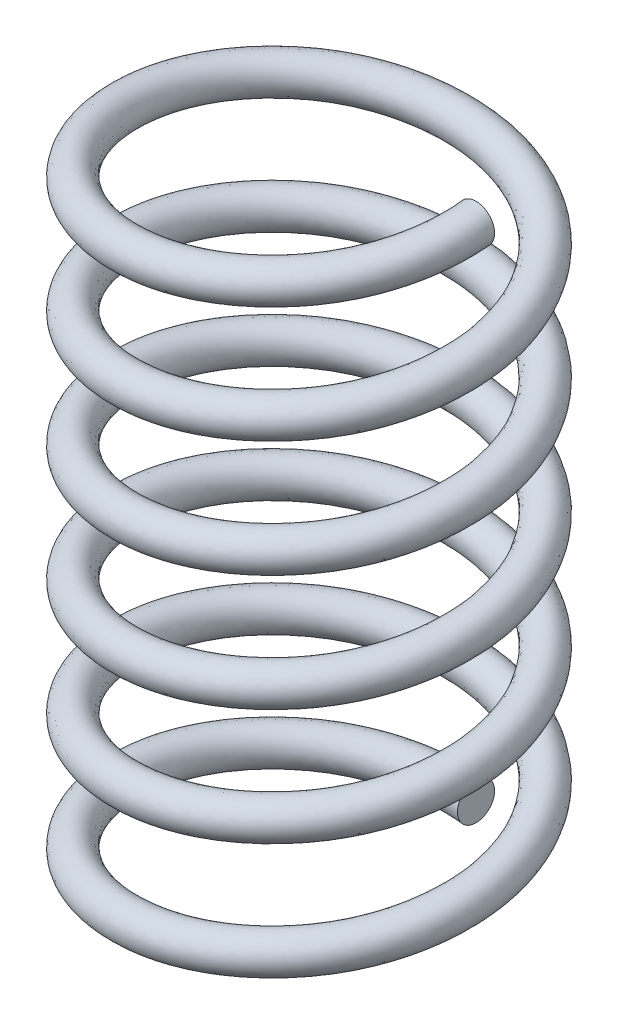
ISO-10303-21;
HEADER;
FILE_DESCRIPTION(('STEP AP214'),'2;1');
FILE_NAME('part.step','',(''),(''),'','','');
FILE_SCHEMA(('AUTOMOTIVE_DESIGN { 1 0 10303 214 1 1 1 1 }'));
ENDSEC;
DATA;
#1=APPLICATION_CONTEXT('core data for automotive mechanical design processes');
#2=APPLICATION_PROTOCOL_DEFINITION('international standard','automotive_design',2000,#1);
#3=PRODUCT_CONTEXT('',#1,'mechanical');
#4=PRODUCT('Part','Part','',(#3));
#5=PRODUCT_RELATED_PRODUCT_CATEGORY('part','',(#4));
#6=PRODUCT_DEFINITION_FORMATION('','',#4);
#7=PRODUCT_DEFINITION_CONTEXT('part definition',#1,'design');
#8=PRODUCT_DEFINITION('design','',#6,#7);
#9=PRODUCT_DEFINITION_SHAPE('','',#8);
#10=(LENGTH_UNIT() NAMED_UNIT(*) SI_UNIT(.MILLI.,.METRE.));
#11=(NAMED_UNIT(*) PLANE_ANGLE_UNIT() SI_UNIT($,.RADIAN.));
#12=(NAMED_UNIT(*) SI_UNIT($,.STERADIAN.) SOLID_ANGLE_UNIT());
#13=UNCERTAINTY_MEASURE_WITH_UNIT(LENGTH_MEASURE(1.E-05),#10,'distance_accuracy_value','');
#14=(GEOMETRIC_REPRESENTATION_CONTEXT(3) GLOBAL_UNCERTAINTY_ASSIGNED_CONTEXT((#13)) GLOBAL_UNIT_ASSIGNED_CONTEXT((#10,
#11,#12)) REPRESENTATION_CONTEXT('',''));
#15=CARTESIAN_POINT('',(0.,0.,0.));
#16=DIRECTION('',(0.,0.,1.));
#17=DIRECTION('',(1.,0.,0.));
#18=AXIS2_PLACEMENT_3D('',#15,#16,#17);
#19=CARTESIAN_POINT('',(0.,0.,-22.5));
#20=DIRECTION('',(1.,0.,0.));
#21=DIRECTION('',(0.,0.,-1.));
#22=AXIS2_PLACEMENT_3D('',#19,#20,#21);
#23=PLANE('',#22);
#24=CARTESIAN_POINT('',(0.,0.,-22.5));
#25=DIRECTION('',(1.,0.,0.));
#26=DIRECTION('',(0.,0.,-1.));
#27=AXIS2_PLACEMENT_3D('',#24,#25,#26);
#28=CIRCLE('',#27,2.5);
#29=CARTESIAN_POINT('',(0.,0.,-25.));
#30=VERTEX_POINT('',#29);
#31=EDGE_CURVE('E44',#30,#30,#28,.T.);
#32=ORIENTED_EDGE('',*,*,#31,.T.);
#33=EDGE_LOOP('',(#32));
#34=FACE_BOUND('',#33,.T.);
#35=ADVANCED_FACE('F39',(#34),#23,.T.);
#36=CARTESIAN_POINT('',(22.5,90.,-1.84680962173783E-12));
#37=DIRECTION('',(0.,0.,1.));
#38=DIRECTION('',(1.,0.,0.));
#39=AXIS2_PLACEMENT_3D('',#36,#37,#38);
#40=PLANE('',#39);
#41=CARTESIAN_POINT('',(22.5,90.,-1.84680962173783E-12));
#42=DIRECTION('',(0.,0.,1.));
#43=DIRECTION('',(1.,0.,0.));
#44=AXIS2_PLACEMENT_3D('',#41,#42,#43);
#45=CIRCLE('',#44,2.5);
#46=CARTESIAN_POINT('',(25.,90.,-2.05201069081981E-12));
#47=VERTEX_POINT('',#46);
#48=EDGE_CURVE('E10',#47,#47,#45,.T.);
#49=ORIENTED_EDGE('',*,*,#48,.F.);
#50=EDGE_LOOP('',(#49));
#51=FACE_BOUND('',#50,.T.);
#52=ADVANCED_FACE('F53',(#51),#40,.F.);
#53=CARTESIAN_POINT('',(0.,0.,-25.));
#54=CARTESIAN_POINT('',(-10.3553390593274,0.978260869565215,-25.));
#55=CARTESIAN_POINT('',(-17.6776695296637,1.95652173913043,-17.6776695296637));
#56=CARTESIAN_POINT('',(-25.,2.93478260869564,-10.3553390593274));
#57=CARTESIAN_POINT('',(-25.,3.91304347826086,0.));
#58=CARTESIAN_POINT('',(-25.,4.89130434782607,10.3553390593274));
#59=CARTESIAN_POINT('',(-17.6776695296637,5.86956521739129,17.6776695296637));
#60=CARTESIAN_POINT('',(-10.3553390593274,6.8478260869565,25.));
#61=CARTESIAN_POINT('',(0.,7.82608695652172,25.));
#62=CARTESIAN_POINT('',(10.3553390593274,8.80434782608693,25.));
#63=CARTESIAN_POINT('',(17.6776695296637,9.78260869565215,17.6776695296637));
#64=CARTESIAN_POINT('',(25.,10.7608695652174,10.3553390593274));
#65=CARTESIAN_POINT('',(25.,11.7391304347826,0.));
#66=CARTESIAN_POINT('',(25.,12.7173913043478,-10.3553390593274));
#67=CARTESIAN_POINT('',(17.6776695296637,13.695652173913,-17.6776695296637));
#68=CARTESIAN_POINT('',(10.3553390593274,14.6739130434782,-25.));
#69=CARTESIAN_POINT('',(0.,15.6521739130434,-25.));
#70=CARTESIAN_POINT('',(-10.3553390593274,16.6304347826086,-25.));
#71=CARTESIAN_POINT('',(-17.6776695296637,17.6086956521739,-17.6776695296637));
#72=CARTESIAN_POINT('',(-25.,18.5869565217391,-10.3553390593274));
#73=CARTESIAN_POINT('',(-25.,19.5652173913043,0.));
#74=CARTESIAN_POINT('',(-25.,20.5434782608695,10.3553390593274));
#75=CARTESIAN_POINT('',(-17.6776695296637,21.5217391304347,17.6776695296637));
#76=CARTESIAN_POINT('',(-10.3553390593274,22.4999999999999,25.));
#77=CARTESIAN_POINT('',(0.,23.4782608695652,25.));
#78=CARTESIAN_POINT('',(10.3553390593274,24.4565217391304,25.));
#79=CARTESIAN_POINT('',(17.6776695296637,25.4347826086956,17.6776695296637));
#80=CARTESIAN_POINT('',(25.,26.4130434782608,10.3553390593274));
#81=CARTESIAN_POINT('',(25.,27.391304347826,0.));
#82=CARTESIAN_POINT('',(25.,28.3695652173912,-10.3553390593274));
#83=CARTESIAN_POINT('',(17.6776695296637,29.3478260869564,-17.6776695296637));
#84=CARTESIAN_POINT('',(10.3553390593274,30.3260869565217,-25.));
#85=CARTESIAN_POINT('',(0.,31.3043478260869,-25.));
#86=CARTESIAN_POINT('',(-10.3553390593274,32.2826086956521,-25.));
#87=CARTESIAN_POINT('',(-17.6776695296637,33.2608695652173,-17.6776695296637));
#88=CARTESIAN_POINT('',(-25.,34.2391304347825,-10.3553390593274));
#89=CARTESIAN_POINT('',(-25.,35.2173913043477,0.));
#90=CARTESIAN_POINT('',(-25.,36.1956521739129,10.3553390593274));
#91=CARTESIAN_POINT('',(-17.6776695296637,37.1739130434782,17.6776695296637));
#92=CARTESIAN_POINT('',(-10.3553390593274,38.1521739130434,25.));
#93=CARTESIAN_POINT('',(0.,39.1304347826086,25.));
#94=CARTESIAN_POINT('',(10.3553390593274,40.1086956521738,25.));
#95=CARTESIAN_POINT('',(17.6776695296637,41.086956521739,17.6776695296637));
#96=CARTESIAN_POINT('',(25.,42.0652173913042,10.3553390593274));
#97=CARTESIAN_POINT('',(25.,43.0434782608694,0.));
#98=CARTESIAN_POINT('',(25.,44.0217391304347,-10.3553390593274));
#99=CARTESIAN_POINT('',(17.6776695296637,44.9999999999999,-17.6776695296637));
#100=CARTESIAN_POINT('',(10.3553390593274,45.9782608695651,-25.));
#101=CARTESIAN_POINT('',(0.,46.9565217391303,-25.));
#102=CARTESIAN_POINT('',(-10.3553390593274,47.9347826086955,-25.));
#103=CARTESIAN_POINT('',(-17.6776695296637,48.9130434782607,-17.6776695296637));
#104=CARTESIAN_POINT('',(-25.,49.891304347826,-10.3553390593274));
#105=CARTESIAN_POINT('',(-25.,50.8695652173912,0.));
#106=CARTESIAN_POINT('',(-25.,51.8478260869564,10.3553390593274));
#107=CARTESIAN_POINT('',(-17.6776695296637,52.8260869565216,17.6776695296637));
#108=CARTESIAN_POINT('',(-10.3553390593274,53.8043478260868,25.));
#109=CARTESIAN_POINT('',(0.,54.782608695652,25.));
#110=CARTESIAN_POINT('',(10.3553390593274,55.7608695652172,25.));
#111=CARTESIAN_POINT('',(17.6776695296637,56.7391304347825,17.6776695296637));
#112=CARTESIAN_POINT('',(25.,57.7173913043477,10.3553390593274));
#113=CARTESIAN_POINT('',(25.,58.6956521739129,0.));
#114=CARTESIAN_POINT('',(25.,59.6739130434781,-10.3553390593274));
#115=CARTESIAN_POINT('',(17.6776695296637,60.6521739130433,-17.6776695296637));
#116=CARTESIAN_POINT('',(10.3553390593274,61.6304347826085,-25.));
#117=CARTESIAN_POINT('',(0.,62.6086956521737,-25.));
#118=CARTESIAN_POINT('',(-10.3553390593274,63.586956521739,-25.));
#119=CARTESIAN_POINT('',(-17.6776695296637,64.5652173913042,-17.6776695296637));
#120=CARTESIAN_POINT('',(-25.,65.5434782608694,-10.3553390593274));
#121=CARTESIAN_POINT('',(-25.,66.5217391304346,0.));
#122=CARTESIAN_POINT('',(-25.,67.4999999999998,10.3553390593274));
#123=CARTESIAN_POINT('',(-17.6776695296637,68.478260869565,17.6776695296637));
#124=CARTESIAN_POINT('',(-10.3553390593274,69.4565217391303,25.));
#125=CARTESIAN_POINT('',(0.,70.4347826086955,25.));
#126=CARTESIAN_POINT('',(10.3553390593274,71.4130434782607,25.));
#127=CARTESIAN_POINT('',(17.6776695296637,72.3913043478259,17.6776695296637));
#128=CARTESIAN_POINT('',(25.,73.3695652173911,10.3553390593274));
#129=CARTESIAN_POINT('',(25.,74.3478260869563,0.));
#130=CARTESIAN_POINT('',(25.,75.3260869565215,-10.3553390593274));
#131=CARTESIAN_POINT('',(17.6776695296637,76.3043478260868,-17.6776695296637));
#132=CARTESIAN_POINT('',(10.3553390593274,77.282608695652,-25.));
#133=CARTESIAN_POINT('',(0.,78.2608695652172,-25.));
#134=CARTESIAN_POINT('',(-10.3553390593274,79.2391304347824,-25.));
#135=CARTESIAN_POINT('',(-17.6776695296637,80.2173913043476,-17.6776695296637));
#136=CARTESIAN_POINT('',(-25.,81.1956521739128,-10.3553390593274));
#137=CARTESIAN_POINT('',(-25.,82.173913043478,0.));
#138=CARTESIAN_POINT('',(-25.,83.1521739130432,10.3553390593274));
#139=CARTESIAN_POINT('',(-17.6776695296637,84.1304347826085,17.6776695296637));
#140=CARTESIAN_POINT('',(-10.3553390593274,85.1086956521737,25.));
#141=CARTESIAN_POINT('',(0.,86.0869565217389,25.));
#142=CARTESIAN_POINT('',(10.3553390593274,87.0652173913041,25.));
#143=CARTESIAN_POINT('',(17.6776695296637,88.0434782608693,17.6776695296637));
#144=CARTESIAN_POINT('',(25.,89.0217391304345,10.3553390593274));
#145=CARTESIAN_POINT('',(25.,89.9999999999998,0.));
#146=CARTESIAN_POINT('',(25.,90.978260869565,-10.3553390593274));
#147=CARTESIAN_POINT('',(17.6776695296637,91.9565217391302,-17.6776695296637));
#148=CARTESIAN_POINT('',(10.3553390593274,92.9347826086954,-25.));
#149=CARTESIAN_POINT('',(0.,93.9130434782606,-25.));
#150=CARTESIAN_POINT('',(0.,5.,-25.));
#151=CARTESIAN_POINT('',(-10.3553390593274,5.97826086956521,-25.));
#152=CARTESIAN_POINT('',(-17.6776695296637,6.95652173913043,-17.6776695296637));
#153=CARTESIAN_POINT('',(-25.,7.93478260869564,-10.3553390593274));
#154=CARTESIAN_POINT('',(-25.,8.91304347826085,0.));
#155=CARTESIAN_POINT('',(-25.,9.89130434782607,10.3553390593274));
#156=CARTESIAN_POINT('',(-17.6776695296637,10.8695652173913,17.6776695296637));
#157=CARTESIAN_POINT('',(-10.3553390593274,11.8478260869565,25.));
#158=CARTESIAN_POINT('',(0.,12.8260869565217,25.));
#159=CARTESIAN_POINT('',(10.3553390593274,13.8043478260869,25.));
#160=CARTESIAN_POINT('',(17.6776695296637,14.7826086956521,17.6776695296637));
#161=CARTESIAN_POINT('',(25.,15.7608695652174,10.3553390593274));
#162=CARTESIAN_POINT('',(25.,16.7391304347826,0.));
#163=CARTESIAN_POINT('',(25.,17.7173913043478,-10.3553390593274));
#164=CARTESIAN_POINT('',(17.6776695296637,18.695652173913,-17.6776695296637));
#165=CARTESIAN_POINT('',(10.3553390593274,19.6739130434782,-25.));
#166=CARTESIAN_POINT('',(0.,20.6521739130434,-25.));
#167=CARTESIAN_POINT('',(-10.3553390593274,21.6304347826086,-25.));
#168=CARTESIAN_POINT('',(-17.6776695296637,22.6086956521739,-17.6776695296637));
#169=CARTESIAN_POINT('',(-25.,23.5869565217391,-10.3553390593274));
#170=CARTESIAN_POINT('',(-25.,24.5652173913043,0.));
#171=CARTESIAN_POINT('',(-25.,25.5434782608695,10.3553390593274));
#172=CARTESIAN_POINT('',(-17.6776695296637,26.5217391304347,17.6776695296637));
#173=CARTESIAN_POINT('',(-10.3553390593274,27.4999999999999,25.));
#174=CARTESIAN_POINT('',(0.,28.4782608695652,25.));
#175=CARTESIAN_POINT('',(10.3553390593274,29.4565217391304,25.));
#176=CARTESIAN_POINT('',(17.6776695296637,30.4347826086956,17.6776695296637));
#177=CARTESIAN_POINT('',(25.,31.4130434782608,10.3553390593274));
#178=CARTESIAN_POINT('',(25.,32.391304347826,0.));
#179=CARTESIAN_POINT('',(25.,33.3695652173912,-10.3553390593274));
#180=CARTESIAN_POINT('',(17.6776695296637,34.3478260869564,-17.6776695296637));
#181=CARTESIAN_POINT('',(10.3553390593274,35.3260869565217,-25.));
#182=CARTESIAN_POINT('',(0.,36.3043478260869,-25.));
#183=CARTESIAN_POINT('',(-10.3553390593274,37.2826086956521,-25.));
#184=CARTESIAN_POINT('',(-17.6776695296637,38.2608695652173,-17.6776695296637));
#185=CARTESIAN_POINT('',(-25.,39.2391304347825,-10.3553390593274));
#186=CARTESIAN_POINT('',(-25.,40.2173913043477,0.));
#187=CARTESIAN_POINT('',(-25.,41.1956521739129,10.3553390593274));
#188=CARTESIAN_POINT('',(-17.6776695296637,42.1739130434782,17.6776695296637));
#189=CARTESIAN_POINT('',(-10.3553390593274,43.1521739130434,25.));
#190=CARTESIAN_POINT('',(0.,44.1304347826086,25.));
#191=CARTESIAN_POINT('',(10.3553390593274,45.1086956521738,25.));
#192=CARTESIAN_POINT('',(17.6776695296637,46.086956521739,17.6776695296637));
#193=CARTESIAN_POINT('',(25.,47.0652173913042,10.3553390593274));
#194=CARTESIAN_POINT('',(25.,48.0434782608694,0.));
#195=CARTESIAN_POINT('',(25.,49.0217391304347,-10.3553390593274));
#196=CARTESIAN_POINT('',(17.6776695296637,49.9999999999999,-17.6776695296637));
#197=CARTESIAN_POINT('',(10.3553390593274,50.9782608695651,-25.));
#198=CARTESIAN_POINT('',(0.,51.9565217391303,-25.));
#199=CARTESIAN_POINT('',(-10.3553390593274,52.9347826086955,-25.));
#200=CARTESIAN_POINT('',(-17.6776695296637,53.9130434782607,-17.6776695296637));
#201=CARTESIAN_POINT('',(-25.,54.891304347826,-10.3553390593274));
#202=CARTESIAN_POINT('',(-25.,55.8695652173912,0.));
#203=CARTESIAN_POINT('',(-25.,56.8478260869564,10.3553390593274));
#204=CARTESIAN_POINT('',(-17.6776695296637,57.8260869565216,17.6776695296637));
#205=CARTESIAN_POINT('',(-10.3553390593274,58.8043478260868,25.));
#206=CARTESIAN_POINT('',(0.,59.782608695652,25.));
#207=CARTESIAN_POINT('',(10.3553390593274,60.7608695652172,25.));
#208=CARTESIAN_POINT('',(17.6776695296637,61.7391304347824,17.6776695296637));
#209=CARTESIAN_POINT('',(25.,62.7173913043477,10.3553390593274));
#210=CARTESIAN_POINT('',(25.,63.6956521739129,0.));
#211=CARTESIAN_POINT('',(25.,64.6739130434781,-10.3553390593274));
#212=CARTESIAN_POINT('',(17.6776695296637,65.6521739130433,-17.6776695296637));
#213=CARTESIAN_POINT('',(10.3553390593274,66.6304347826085,-25.));
#214=CARTESIAN_POINT('',(0.,67.6086956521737,-25.));
#215=CARTESIAN_POINT('',(-10.3553390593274,68.586956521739,-25.));
#216=CARTESIAN_POINT('',(-17.6776695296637,69.5652173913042,-17.6776695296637));
#217=CARTESIAN_POINT('',(-25.,70.5434782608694,-10.3553390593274));
#218=CARTESIAN_POINT('',(-25.,71.5217391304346,0.));
#219=CARTESIAN_POINT('',(-25.,72.4999999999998,10.3553390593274));
#220=CARTESIAN_POINT('',(-17.6776695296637,73.478260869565,17.6776695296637));
#221=CARTESIAN_POINT('',(-10.3553390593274,74.4565217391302,25.));
#222=CARTESIAN_POINT('',(0.,75.4347826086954,25.));
#223=CARTESIAN_POINT('',(10.3553390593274,76.4130434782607,25.));
#224=CARTESIAN_POINT('',(17.6776695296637,77.3913043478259,17.6776695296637));
#225=CARTESIAN_POINT('',(25.,78.3695652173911,10.3553390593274));
#226=CARTESIAN_POINT('',(25.,79.3478260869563,0.));
#227=CARTESIAN_POINT('',(25.,80.3260869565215,-10.3553390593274));
#228=CARTESIAN_POINT('',(17.6776695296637,81.3043478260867,-17.6776695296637));
#229=CARTESIAN_POINT('',(10.3553390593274,82.2826086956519,-25.));
#230=CARTESIAN_POINT('',(0.,83.2608695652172,-25.));
#231=CARTESIAN_POINT('',(-10.3553390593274,84.2391304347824,-25.));
#232=CARTESIAN_POINT('',(-17.6776695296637,85.2173913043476,-17.6776695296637));
#233=CARTESIAN_POINT('',(-25.,86.1956521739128,-10.3553390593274));
#234=CARTESIAN_POINT('',(-25.,87.173913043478,0.));
#235=CARTESIAN_POINT('',(-25.,88.1521739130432,10.3553390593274));
#236=CARTESIAN_POINT('',(-17.6776695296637,89.1304347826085,17.6776695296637));
#237=CARTESIAN_POINT('',(-10.3553390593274,90.1086956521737,25.));
#238=CARTESIAN_POINT('',(0.,91.0869565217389,25.));
#239=CARTESIAN_POINT('',(10.3553390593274,92.0652173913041,25.));
#240=CARTESIAN_POINT('',(17.6776695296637,93.0434782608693,17.6776695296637));
#241=CARTESIAN_POINT('',(25.,94.0217391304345,10.3553390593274));
#242=CARTESIAN_POINT('',(25.,94.9999999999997,0.));
#243=CARTESIAN_POINT('',(25.,95.978260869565,-10.3553390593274));
#244=CARTESIAN_POINT('',(17.6776695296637,96.9565217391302,-17.6776695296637));
#245=CARTESIAN_POINT('',(10.3553390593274,97.9347826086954,-25.));
#246=CARTESIAN_POINT('',(0.,98.9130434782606,-25.));
#247=CARTESIAN_POINT('',(0.,5.,-20.));
#248=CARTESIAN_POINT('',(-8.2842712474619,5.97826086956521,-20.));
#249=CARTESIAN_POINT('',(-14.1421356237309,6.95652173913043,-14.142135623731));
#250=CARTESIAN_POINT('',(-20.,7.93478260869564,-8.2842712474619));
#251=CARTESIAN_POINT('',(-20.,8.91304347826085,0.));
#252=CARTESIAN_POINT('',(-20.,9.89130434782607,8.2842712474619));
#253=CARTESIAN_POINT('',(-14.1421356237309,10.8695652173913,14.1421356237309));
#254=CARTESIAN_POINT('',(-8.2842712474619,11.8478260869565,20.));
#255=CARTESIAN_POINT('',(0.,12.8260869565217,20.));
#256=CARTESIAN_POINT('',(8.2842712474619,13.8043478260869,20.));
#257=CARTESIAN_POINT('',(14.1421356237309,14.7826086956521,14.142135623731));
#258=CARTESIAN_POINT('',(20.,15.7608695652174,8.28427124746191));
#259=CARTESIAN_POINT('',(20.,16.7391304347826,0.));
#260=CARTESIAN_POINT('',(20.,17.7173913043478,-8.28427124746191));
#261=CARTESIAN_POINT('',(14.142135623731,18.695652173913,-14.1421356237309));
#262=CARTESIAN_POINT('',(8.28427124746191,19.6739130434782,-20.));
#263=CARTESIAN_POINT('',(0.,20.6521739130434,-20.));
#264=CARTESIAN_POINT('',(-8.2842712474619,21.6304347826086,-20.));
#265=CARTESIAN_POINT('',(-14.1421356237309,22.6086956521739,-14.142135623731));
#266=CARTESIAN_POINT('',(-20.,23.5869565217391,-8.2842712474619));
#267=CARTESIAN_POINT('',(-20.,24.5652173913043,0.));
#268=CARTESIAN_POINT('',(-20.,25.5434782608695,8.2842712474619));
#269=CARTESIAN_POINT('',(-14.1421356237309,26.5217391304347,14.1421356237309));
#270=CARTESIAN_POINT('',(-8.2842712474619,27.4999999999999,20.));
#271=CARTESIAN_POINT('',(0.,28.4782608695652,20.));
#272=CARTESIAN_POINT('',(8.2842712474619,29.4565217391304,20.));
#273=CARTESIAN_POINT('',(14.1421356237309,30.4347826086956,14.142135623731));
#274=CARTESIAN_POINT('',(20.,31.4130434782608,8.28427124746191));
#275=CARTESIAN_POINT('',(20.,32.391304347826,0.));
#276=CARTESIAN_POINT('',(20.,33.3695652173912,-8.28427124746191));
#277=CARTESIAN_POINT('',(14.142135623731,34.3478260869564,-14.1421356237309));
#278=CARTESIAN_POINT('',(8.28427124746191,35.3260869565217,-20.));
#279=CARTESIAN_POINT('',(0.,36.3043478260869,-20.));
#280=CARTESIAN_POINT('',(-8.2842712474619,37.2826086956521,-20.));
#281=CARTESIAN_POINT('',(-14.1421356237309,38.2608695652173,-14.142135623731));
#282=CARTESIAN_POINT('',(-20.,39.2391304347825,-8.2842712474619));
#283=CARTESIAN_POINT('',(-20.,40.2173913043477,0.));
#284=CARTESIAN_POINT('',(-20.,41.1956521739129,8.2842712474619));
#285=CARTESIAN_POINT('',(-14.1421356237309,42.1739130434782,14.1421356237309));
#286=CARTESIAN_POINT('',(-8.2842712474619,43.1521739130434,20.));
#287=CARTESIAN_POINT('',(0.,44.1304347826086,20.));
#288=CARTESIAN_POINT('',(8.2842712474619,45.1086956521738,20.));
#289=CARTESIAN_POINT('',(14.1421356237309,46.086956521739,14.142135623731));
#290=CARTESIAN_POINT('',(20.,47.0652173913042,8.28427124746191));
#291=CARTESIAN_POINT('',(20.,48.0434782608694,0.));
#292=CARTESIAN_POINT('',(20.,49.0217391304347,-8.28427124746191));
#293=CARTESIAN_POINT('',(14.142135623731,49.9999999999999,-14.1421356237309));
#294=CARTESIAN_POINT('',(8.28427124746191,50.9782608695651,-20.));
#295=CARTESIAN_POINT('',(0.,51.9565217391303,-20.));
#296=CARTESIAN_POINT('',(-8.2842712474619,52.9347826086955,-20.));
#297=CARTESIAN_POINT('',(-14.1421356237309,53.9130434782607,-14.142135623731));
#298=CARTESIAN_POINT('',(-20.,54.891304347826,-8.2842712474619));
#299=CARTESIAN_POINT('',(-20.,55.8695652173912,0.));
#300=CARTESIAN_POINT('',(-20.,56.8478260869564,8.2842712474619));
#301=CARTESIAN_POINT('',(-14.1421356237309,57.8260869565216,14.1421356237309));
#302=CARTESIAN_POINT('',(-8.2842712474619,58.8043478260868,20.));
#303=CARTESIAN_POINT('',(0.,59.782608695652,20.));
#304=CARTESIAN_POINT('',(8.2842712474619,60.7608695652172,20.));
#305=CARTESIAN_POINT('',(14.1421356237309,61.7391304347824,14.142135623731));
#306=CARTESIAN_POINT('',(20.,62.7173913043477,8.28427124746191));
#307=CARTESIAN_POINT('',(20.,63.6956521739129,0.));
#308=CARTESIAN_POINT('',(20.,64.6739130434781,-8.28427124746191));
#309=CARTESIAN_POINT('',(14.142135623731,65.6521739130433,-14.1421356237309));
#310=CARTESIAN_POINT('',(8.28427124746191,66.6304347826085,-20.));
#311=CARTESIAN_POINT('',(0.,67.6086956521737,-20.));
#312=CARTESIAN_POINT('',(-8.2842712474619,68.586956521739,-20.));
#313=CARTESIAN_POINT('',(-14.1421356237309,69.5652173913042,-14.142135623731));
#314=CARTESIAN_POINT('',(-20.,70.5434782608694,-8.2842712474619));
#315=CARTESIAN_POINT('',(-20.,71.5217391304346,0.));
#316=CARTESIAN_POINT('',(-20.,72.4999999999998,8.2842712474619));
#317=CARTESIAN_POINT('',(-14.1421356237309,73.478260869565,14.1421356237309));
#318=CARTESIAN_POINT('',(-8.2842712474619,74.4565217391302,20.));
#319=CARTESIAN_POINT('',(0.,75.4347826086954,20.));
#320=CARTESIAN_POINT('',(8.2842712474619,76.4130434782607,20.));
#321=CARTESIAN_POINT('',(14.1421356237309,77.3913043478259,14.142135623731));
#322=CARTESIAN_POINT('',(20.,78.3695652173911,8.28427124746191));
#323=CARTESIAN_POINT('',(20.,79.3478260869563,0.));
#324=CARTESIAN_POINT('',(20.,80.3260869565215,-8.28427124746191));
#325=CARTESIAN_POINT('',(14.142135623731,81.3043478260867,-14.1421356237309));
#326=CARTESIAN_POINT('',(8.28427124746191,82.2826086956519,-20.));
#327=CARTESIAN_POINT('',(0.,83.2608695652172,-20.));
#328=CARTESIAN_POINT('',(-8.2842712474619,84.2391304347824,-20.));
#329=CARTESIAN_POINT('',(-14.1421356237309,85.2173913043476,-14.142135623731));
#330=CARTESIAN_POINT('',(-20.,86.1956521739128,-8.2842712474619));
#331=CARTESIAN_POINT('',(-20.,87.173913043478,0.));
#332=CARTESIAN_POINT('',(-20.,88.1521739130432,8.2842712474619));
#333=CARTESIAN_POINT('',(-14.1421356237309,89.1304347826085,14.1421356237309));
#334=CARTESIAN_POINT('',(-8.2842712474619,90.1086956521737,20.));
#335=CARTESIAN_POINT('',(0.,91.0869565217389,20.));
#336=CARTESIAN_POINT('',(8.2842712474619,92.0652173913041,20.));
#337=CARTESIAN_POINT('',(14.1421356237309,93.0434782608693,14.142135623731));
#338=CARTESIAN_POINT('',(20.,94.0217391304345,8.28427124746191));
#339=CARTESIAN_POINT('',(20.,94.9999999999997,0.));
#340=CARTESIAN_POINT('',(20.,95.978260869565,-8.28427124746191));
#341=CARTESIAN_POINT('',(14.142135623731,96.9565217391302,-14.1421356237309));
#342=CARTESIAN_POINT('',(8.28427124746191,97.9347826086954,-20.));
#343=CARTESIAN_POINT('',(0.,98.9130434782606,-20.));
#344=CARTESIAN_POINT('',(0.,0.,-20.));
#345=CARTESIAN_POINT('',(-8.2842712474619,0.978260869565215,-20.));
#346=CARTESIAN_POINT('',(-14.1421356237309,1.95652173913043,-14.142135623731));
#347=CARTESIAN_POINT('',(-20.,2.93478260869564,-8.2842712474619));
#348=CARTESIAN_POINT('',(-20.,3.91304347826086,0.));
#349=CARTESIAN_POINT('',(-20.,4.89130434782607,8.2842712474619));
#350=CARTESIAN_POINT('',(-14.1421356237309,5.86956521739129,14.1421356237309));
#351=CARTESIAN_POINT('',(-8.2842712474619,6.8478260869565,20.));
#352=CARTESIAN_POINT('',(0.,7.82608695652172,20.));
#353=CARTESIAN_POINT('',(8.2842712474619,8.80434782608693,20.));
#354=CARTESIAN_POINT('',(14.1421356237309,9.78260869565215,14.142135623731));
#355=CARTESIAN_POINT('',(20.,10.7608695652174,8.28427124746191));
#356=CARTESIAN_POINT('',(20.,11.7391304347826,0.));
#357=CARTESIAN_POINT('',(20.,12.7173913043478,-8.28427124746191));
#358=CARTESIAN_POINT('',(14.142135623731,13.695652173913,-14.1421356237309));
#359=CARTESIAN_POINT('',(8.28427124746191,14.6739130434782,-20.));
#360=CARTESIAN_POINT('',(0.,15.6521739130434,-20.));
#361=CARTESIAN_POINT('',(-8.2842712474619,16.6304347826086,-20.));
#362=CARTESIAN_POINT('',(-14.1421356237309,17.6086956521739,-14.142135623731));
#363=CARTESIAN_POINT('',(-20.,18.5869565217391,-8.2842712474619));
#364=CARTESIAN_POINT('',(-20.,19.5652173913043,0.));
#365=CARTESIAN_POINT('',(-20.,20.5434782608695,8.2842712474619));
#366=CARTESIAN_POINT('',(-14.1421356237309,21.5217391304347,14.1421356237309));
#367=CARTESIAN_POINT('',(-8.2842712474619,22.4999999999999,20.));
#368=CARTESIAN_POINT('',(0.,23.4782608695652,20.));
#369=CARTESIAN_POINT('',(8.2842712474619,24.4565217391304,20.));
#370=CARTESIAN_POINT('',(14.1421356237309,25.4347826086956,14.142135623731));
#371=CARTESIAN_POINT('',(20.,26.4130434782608,8.28427124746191));
#372=CARTESIAN_POINT('',(20.,27.391304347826,0.));
#373=CARTESIAN_POINT('',(20.,28.3695652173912,-8.28427124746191));
#374=CARTESIAN_POINT('',(14.142135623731,29.3478260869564,-14.1421356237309));
#375=CARTESIAN_POINT('',(8.28427124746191,30.3260869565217,-20.));
#376=CARTESIAN_POINT('',(0.,31.3043478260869,-20.));
#377=CARTESIAN_POINT('',(-8.2842712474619,32.2826086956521,-20.));
#378=CARTESIAN_POINT('',(-14.1421356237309,33.2608695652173,-14.142135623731));
#379=CARTESIAN_POINT('',(-20.,34.2391304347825,-8.2842712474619));
#380=CARTESIAN_POINT('',(-20.,35.2173913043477,0.));
#381=CARTESIAN_POINT('',(-20.,36.1956521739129,8.2842712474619));
#382=CARTESIAN_POINT('',(-14.1421356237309,37.1739130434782,14.1421356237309));
#383=CARTESIAN_POINT('',(-8.2842712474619,38.1521739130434,20.));
#384=CARTESIAN_POINT('',(0.,39.1304347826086,20.));
#385=CARTESIAN_POINT('',(8.2842712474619,40.1086956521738,20.));
#386=CARTESIAN_POINT('',(14.1421356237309,41.086956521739,14.142135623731));
#387=CARTESIAN_POINT('',(20.,42.0652173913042,8.28427124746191));
#388=CARTESIAN_POINT('',(20.,43.0434782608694,0.));
#389=CARTESIAN_POINT('',(20.,44.0217391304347,-8.28427124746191));
#390=CARTESIAN_POINT('',(14.142135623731,44.9999999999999,-14.1421356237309));
#391=CARTESIAN_POINT('',(8.28427124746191,45.9782608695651,-20.));
#392=CARTESIAN_POINT('',(0.,46.9565217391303,-20.));
#393=CARTESIAN_POINT('',(-8.2842712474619,47.9347826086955,-20.));
#394=CARTESIAN_POINT('',(-14.1421356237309,48.9130434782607,-14.142135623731));
#395=CARTESIAN_POINT('',(-20.,49.891304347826,-8.2842712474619));
#396=CARTESIAN_POINT('',(-20.,50.8695652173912,0.));
#397=CARTESIAN_POINT('',(-20.,51.8478260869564,8.2842712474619));
#398=CARTESIAN_POINT('',(-14.1421356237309,52.8260869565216,14.1421356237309));
#399=CARTESIAN_POINT('',(-8.2842712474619,53.8043478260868,20.));
#400=CARTESIAN_POINT('',(0.,54.782608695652,20.));
#401=CARTESIAN_POINT('',(8.2842712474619,55.7608695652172,20.));
#402=CARTESIAN_POINT('',(14.1421356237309,56.7391304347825,14.142135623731));
#403=CARTESIAN_POINT('',(20.,57.7173913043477,8.28427124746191));
#404=CARTESIAN_POINT('',(20.,58.6956521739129,0.));
#405=CARTESIAN_POINT('',(20.,59.6739130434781,-8.28427124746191));
#406=CARTESIAN_POINT('',(14.142135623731,60.6521739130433,-14.1421356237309));
#407=CARTESIAN_POINT('',(8.28427124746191,61.6304347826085,-20.));
#408=CARTESIAN_POINT('',(0.,62.6086956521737,-20.));
#409=CARTESIAN_POINT('',(-8.2842712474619,63.586956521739,-20.));
#410=CARTESIAN_POINT('',(-14.1421356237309,64.5652173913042,-14.142135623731));
#411=CARTESIAN_POINT('',(-20.,65.5434782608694,-8.2842712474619));
#412=CARTESIAN_POINT('',(-20.,66.5217391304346,0.));
#413=CARTESIAN_POINT('',(-20.,67.4999999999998,8.2842712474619));
#414=CARTESIAN_POINT('',(-14.1421356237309,68.478260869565,14.1421356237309));
#415=CARTESIAN_POINT('',(-8.2842712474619,69.4565217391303,20.));
#416=CARTESIAN_POINT('',(0.,70.4347826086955,20.));
#417=CARTESIAN_POINT('',(8.2842712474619,71.4130434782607,20.));
#418=CARTESIAN_POINT('',(14.1421356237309,72.3913043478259,14.142135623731));
#419=CARTESIAN_POINT('',(20.,73.3695652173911,8.28427124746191));
#420=CARTESIAN_POINT('',(20.,74.3478260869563,0.));
#421=CARTESIAN_POINT('',(20.,75.3260869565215,-8.28427124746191));
#422=CARTESIAN_POINT('',(14.142135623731,76.3043478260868,-14.1421356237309));
#423=CARTESIAN_POINT('',(8.28427124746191,77.282608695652,-20.));
#424=CARTESIAN_POINT('',(0.,78.2608695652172,-20.));
#425=CARTESIAN_POINT('',(-8.2842712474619,79.2391304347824,-20.));
#426=CARTESIAN_POINT('',(-14.1421356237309,80.2173913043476,-14.142135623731));
#427=CARTESIAN_POINT('',(-20.,81.1956521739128,-8.2842712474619));
#428=CARTESIAN_POINT('',(-20.,82.173913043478,0.));
#429=CARTESIAN_POINT('',(-20.,83.1521739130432,8.2842712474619));
#430=CARTESIAN_POINT('',(-14.1421356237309,84.1304347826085,14.1421356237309));
#431=CARTESIAN_POINT('',(-8.2842712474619,85.1086956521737,20.));
#432=CARTESIAN_POINT('',(0.,86.0869565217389,20.));
#433=CARTESIAN_POINT('',(8.2842712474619,87.0652173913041,20.));
#434=CARTESIAN_POINT('',(14.1421356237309,88.0434782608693,14.142135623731));
#435=CARTESIAN_POINT('',(20.,89.0217391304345,8.28427124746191));
#436=CARTESIAN_POINT('',(20.,89.9999999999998,0.));
#437=CARTESIAN_POINT('',(20.,90.978260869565,-8.28427124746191));
#438=CARTESIAN_POINT('',(14.142135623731,91.9565217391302,-14.1421356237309));
#439=CARTESIAN_POINT('',(8.28427124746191,92.9347826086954,-20.));
#440=CARTESIAN_POINT('',(0.,93.9130434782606,-20.));
#441=CARTESIAN_POINT('',(0.,-5.,-20.));
#442=CARTESIAN_POINT('',(-8.2842712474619,-4.02173913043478,-20.));
#443=CARTESIAN_POINT('',(-14.1421356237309,-3.04347826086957,-14.142135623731));
#444=CARTESIAN_POINT('',(-20.,-2.06521739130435,-8.2842712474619));
#445=CARTESIAN_POINT('',(-20.,-1.08695652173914,0.));
#446=CARTESIAN_POINT('',(-20.,-0.108695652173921,8.2842712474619));
#447=CARTESIAN_POINT('',(-14.1421356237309,0.869565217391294,14.1421356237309));
#448=CARTESIAN_POINT('',(-8.2842712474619,1.84782608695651,20.));
#449=CARTESIAN_POINT('',(0.,2.82608695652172,20.));
#450=CARTESIAN_POINT('',(8.2842712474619,3.80434782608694,20.));
#451=CARTESIAN_POINT('',(14.1421356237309,4.78260869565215,14.142135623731));
#452=CARTESIAN_POINT('',(20.,5.76086956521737,8.28427124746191));
#453=CARTESIAN_POINT('',(20.,6.73913043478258,0.));
#454=CARTESIAN_POINT('',(20.,7.7173913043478,-8.28427124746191));
#455=CARTESIAN_POINT('',(14.142135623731,8.69565217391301,-14.1421356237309));
#456=CARTESIAN_POINT('',(8.28427124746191,9.67391304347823,-20.));
#457=CARTESIAN_POINT('',(0.,10.6521739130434,-20.));
#458=CARTESIAN_POINT('',(-8.2842712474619,11.6304347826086,-20.));
#459=CARTESIAN_POINT('',(-14.1421356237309,12.6086956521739,-14.142135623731));
#460=CARTESIAN_POINT('',(-20.,13.5869565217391,-8.2842712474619));
#461=CARTESIAN_POINT('',(-20.,14.5652173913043,0.));
#462=CARTESIAN_POINT('',(-20.,15.5434782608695,8.2842712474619));
#463=CARTESIAN_POINT('',(-14.1421356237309,16.5217391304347,14.1421356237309));
#464=CARTESIAN_POINT('',(-8.2842712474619,17.5,20.));
#465=CARTESIAN_POINT('',(0.,18.4782608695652,20.));
#466=CARTESIAN_POINT('',(8.2842712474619,19.4565217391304,20.));
#467=CARTESIAN_POINT('',(14.1421356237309,20.4347826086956,14.142135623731));
#468=CARTESIAN_POINT('',(20.,21.4130434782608,8.28427124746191));
#469=CARTESIAN_POINT('',(20.,22.391304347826,0.));
#470=CARTESIAN_POINT('',(20.,23.3695652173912,-8.28427124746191));
#471=CARTESIAN_POINT('',(14.142135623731,24.3478260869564,-14.1421356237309));
#472=CARTESIAN_POINT('',(8.28427124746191,25.3260869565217,-20.));
#473=CARTESIAN_POINT('',(0.,26.3043478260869,-20.));
#474=CARTESIAN_POINT('',(-8.2842712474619,27.2826086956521,-20.));
#475=CARTESIAN_POINT('',(-14.1421356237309,28.2608695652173,-14.142135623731));
#476=CARTESIAN_POINT('',(-20.,29.2391304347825,-8.2842712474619));
#477=CARTESIAN_POINT('',(-20.,30.2173913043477,0.));
#478=CARTESIAN_POINT('',(-20.,31.1956521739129,8.2842712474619));
#479=CARTESIAN_POINT('',(-14.1421356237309,32.1739130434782,14.1421356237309));
#480=CARTESIAN_POINT('',(-8.2842712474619,33.1521739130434,20.));
#481=CARTESIAN_POINT('',(0.,34.1304347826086,20.));
#482=CARTESIAN_POINT('',(8.2842712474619,35.1086956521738,20.));
#483=CARTESIAN_POINT('',(14.1421356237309,36.086956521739,14.142135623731));
#484=CARTESIAN_POINT('',(20.,37.0652173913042,8.28427124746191));
#485=CARTESIAN_POINT('',(20.,38.0434782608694,0.));
#486=CARTESIAN_POINT('',(20.,39.0217391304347,-8.28427124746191));
#487=CARTESIAN_POINT('',(14.142135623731,39.9999999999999,-14.1421356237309));
#488=CARTESIAN_POINT('',(8.28427124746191,40.9782608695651,-20.));
#489=CARTESIAN_POINT('',(0.,41.9565217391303,-20.));
#490=CARTESIAN_POINT('',(-8.2842712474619,42.9347826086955,-20.));
#491=CARTESIAN_POINT('',(-14.1421356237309,43.9130434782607,-14.142135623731));
#492=CARTESIAN_POINT('',(-20.,44.891304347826,-8.2842712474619));
#493=CARTESIAN_POINT('',(-20.,45.8695652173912,0.));
#494=CARTESIAN_POINT('',(-20.,46.8478260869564,8.2842712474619));
#495=CARTESIAN_POINT('',(-14.1421356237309,47.8260869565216,14.1421356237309));
#496=CARTESIAN_POINT('',(-8.2842712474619,48.8043478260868,20.));
#497=CARTESIAN_POINT('',(0.,49.782608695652,20.));
#498=CARTESIAN_POINT('',(8.2842712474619,50.7608695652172,20.));
#499=CARTESIAN_POINT('',(14.1421356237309,51.7391304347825,14.142135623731));
#500=CARTESIAN_POINT('',(20.,52.7173913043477,8.28427124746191));
#501=CARTESIAN_POINT('',(20.,53.6956521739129,0.));
#502=CARTESIAN_POINT('',(20.,54.6739130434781,-8.28427124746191));
#503=CARTESIAN_POINT('',(14.142135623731,55.6521739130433,-14.1421356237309));
#504=CARTESIAN_POINT('',(8.28427124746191,56.6304347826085,-20.));
#505=CARTESIAN_POINT('',(0.,57.6086956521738,-20.));
#506=CARTESIAN_POINT('',(-8.2842712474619,58.586956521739,-20.));
#507=CARTESIAN_POINT('',(-14.1421356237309,59.5652173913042,-14.142135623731));
#508=CARTESIAN_POINT('',(-20.,60.5434782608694,-8.2842712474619));
#509=CARTESIAN_POINT('',(-20.,61.5217391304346,0.));
#510=CARTESIAN_POINT('',(-20.,62.4999999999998,8.2842712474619));
#511=CARTESIAN_POINT('',(-14.1421356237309,63.478260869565,14.1421356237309));
#512=CARTESIAN_POINT('',(-8.2842712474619,64.4565217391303,20.));
#513=CARTESIAN_POINT('',(0.,65.4347826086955,20.));
#514=CARTESIAN_POINT('',(8.2842712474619,66.4130434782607,20.));
#515=CARTESIAN_POINT('',(14.1421356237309,67.3913043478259,14.142135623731));
#516=CARTESIAN_POINT('',(20.,68.3695652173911,8.28427124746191));
#517=CARTESIAN_POINT('',(20.,69.3478260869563,0.));
#518=CARTESIAN_POINT('',(20.,70.3260869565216,-8.28427124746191));
#519=CARTESIAN_POINT('',(14.142135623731,71.3043478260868,-14.1421356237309));
#520=CARTESIAN_POINT('',(8.28427124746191,72.282608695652,-20.));
#521=CARTESIAN_POINT('',(0.,73.2608695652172,-20.));
#522=CARTESIAN_POINT('',(-8.2842712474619,74.2391304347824,-20.));
#523=CARTESIAN_POINT('',(-14.1421356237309,75.2173913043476,-14.142135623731));
#524=CARTESIAN_POINT('',(-20.,76.1956521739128,-8.2842712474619));
#525=CARTESIAN_POINT('',(-20.,77.173913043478,0.));
#526=CARTESIAN_POINT('',(-20.,78.1521739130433,8.2842712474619));
#527=CARTESIAN_POINT('',(-14.1421356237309,79.1304347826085,14.1421356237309));
#528=CARTESIAN_POINT('',(-8.2842712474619,80.1086956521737,20.));
#529=CARTESIAN_POINT('',(0.,81.0869565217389,20.));
#530=CARTESIAN_POINT('',(8.2842712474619,82.0652173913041,20.));
#531=CARTESIAN_POINT('',(14.1421356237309,83.0434782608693,14.142135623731));
#532=CARTESIAN_POINT('',(20.,84.0217391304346,8.28427124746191));
#533=CARTESIAN_POINT('',(20.,84.9999999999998,0.));
#534=CARTESIAN_POINT('',(20.,85.978260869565,-8.28427124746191));
#535=CARTESIAN_POINT('',(14.142135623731,86.9565217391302,-14.1421356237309));
#536=CARTESIAN_POINT('',(8.28427124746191,87.9347826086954,-20.));
#537=CARTESIAN_POINT('',(0.,88.9130434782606,-20.));
#538=CARTESIAN_POINT('',(0.,-5.,-25.));
#539=CARTESIAN_POINT('',(-10.3553390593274,-4.02173913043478,-25.));
#540=CARTESIAN_POINT('',(-17.6776695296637,-3.04347826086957,-17.6776695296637));
#541=CARTESIAN_POINT('',(-25.,-2.06521739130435,-10.3553390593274));
#542=CARTESIAN_POINT('',(-25.,-1.08695652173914,0.));
#543=CARTESIAN_POINT('',(-25.,-0.108695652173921,10.3553390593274));
#544=CARTESIAN_POINT('',(-17.6776695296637,0.869565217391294,17.6776695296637));
#545=CARTESIAN_POINT('',(-10.3553390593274,1.84782608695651,25.));
#546=CARTESIAN_POINT('',(0.,2.82608695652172,25.));
#547=CARTESIAN_POINT('',(10.3553390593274,3.80434782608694,25.));
#548=CARTESIAN_POINT('',(17.6776695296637,4.78260869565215,17.6776695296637));
#549=CARTESIAN_POINT('',(25.,5.76086956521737,10.3553390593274));
#550=CARTESIAN_POINT('',(25.,6.73913043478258,0.));
#551=CARTESIAN_POINT('',(25.,7.7173913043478,-10.3553390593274));
#552=CARTESIAN_POINT('',(17.6776695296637,8.69565217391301,-17.6776695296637));
#553=CARTESIAN_POINT('',(10.3553390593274,9.67391304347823,-25.));
#554=CARTESIAN_POINT('',(0.,10.6521739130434,-25.));
#555=CARTESIAN_POINT('',(-10.3553390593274,11.6304347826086,-25.));
#556=CARTESIAN_POINT('',(-17.6776695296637,12.6086956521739,-17.6776695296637));
#557=CARTESIAN_POINT('',(-25.,13.5869565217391,-10.3553390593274));
#558=CARTESIAN_POINT('',(-25.,14.5652173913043,0.));
#559=CARTESIAN_POINT('',(-25.,15.5434782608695,10.3553390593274));
#560=CARTESIAN_POINT('',(-17.6776695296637,16.5217391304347,17.6776695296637));
#561=CARTESIAN_POINT('',(-10.3553390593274,17.5,25.));
#562=CARTESIAN_POINT('',(0.,18.4782608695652,25.));
#563=CARTESIAN_POINT('',(10.3553390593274,19.4565217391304,25.));
#564=CARTESIAN_POINT('',(17.6776695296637,20.4347826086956,17.6776695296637));
#565=CARTESIAN_POINT('',(25.,21.4130434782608,10.3553390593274));
#566=CARTESIAN_POINT('',(25.,22.391304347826,0.));
#567=CARTESIAN_POINT('',(25.,23.3695652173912,-10.3553390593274));
#568=CARTESIAN_POINT('',(17.6776695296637,24.3478260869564,-17.6776695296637));
#569=CARTESIAN_POINT('',(10.3553390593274,25.3260869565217,-25.));
#570=CARTESIAN_POINT('',(0.,26.3043478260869,-25.));
#571=CARTESIAN_POINT('',(-10.3553390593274,27.2826086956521,-25.));
#572=CARTESIAN_POINT('',(-17.6776695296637,28.2608695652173,-17.6776695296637));
#573=CARTESIAN_POINT('',(-25.,29.2391304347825,-10.3553390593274));
#574=CARTESIAN_POINT('',(-25.,30.2173913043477,0.));
#575=CARTESIAN_POINT('',(-25.,31.1956521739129,10.3553390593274));
#576=CARTESIAN_POINT('',(-17.6776695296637,32.1739130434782,17.6776695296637));
#577=CARTESIAN_POINT('',(-10.3553390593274,33.1521739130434,25.));
#578=CARTESIAN_POINT('',(0.,34.1304347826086,25.));
#579=CARTESIAN_POINT('',(10.3553390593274,35.1086956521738,25.));
#580=CARTESIAN_POINT('',(17.6776695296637,36.086956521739,17.6776695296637));
#581=CARTESIAN_POINT('',(25.,37.0652173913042,10.3553390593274));
#582=CARTESIAN_POINT('',(25.,38.0434782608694,0.));
#583=CARTESIAN_POINT('',(25.,39.0217391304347,-10.3553390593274));
#584=CARTESIAN_POINT('',(17.6776695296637,39.9999999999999,-17.6776695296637));
#585=CARTESIAN_POINT('',(10.3553390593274,40.9782608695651,-25.));
#586=CARTESIAN_POINT('',(0.,41.9565217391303,-25.));
#587=CARTESIAN_POINT('',(-10.3553390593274,42.9347826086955,-25.));
#588=CARTESIAN_POINT('',(-17.6776695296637,43.9130434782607,-17.6776695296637));
#589=CARTESIAN_POINT('',(-25.,44.891304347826,-10.3553390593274));
#590=CARTESIAN_POINT('',(-25.,45.8695652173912,0.));
#591=CARTESIAN_POINT('',(-25.,46.8478260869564,10.3553390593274));
#592=CARTESIAN_POINT('',(-17.6776695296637,47.8260869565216,17.6776695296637));
#593=CARTESIAN_POINT('',(-10.3553390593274,48.8043478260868,25.));
#594=CARTESIAN_POINT('',(0.,49.782608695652,25.));
#595=CARTESIAN_POINT('',(10.3553390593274,50.7608695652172,25.));
#596=CARTESIAN_POINT('',(17.6776695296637,51.7391304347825,17.6776695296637));
#597=CARTESIAN_POINT('',(25.,52.7173913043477,10.3553390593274));
#598=CARTESIAN_POINT('',(25.,53.6956521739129,0.));
#599=CARTESIAN_POINT('',(25.,54.6739130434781,-10.3553390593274));
#600=CARTESIAN_POINT('',(17.6776695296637,55.6521739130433,-17.6776695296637));
#601=CARTESIAN_POINT('',(10.3553390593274,56.6304347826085,-25.));
#602=CARTESIAN_POINT('',(0.,57.6086956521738,-25.));
#603=CARTESIAN_POINT('',(-10.3553390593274,58.586956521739,-25.));
#604=CARTESIAN_POINT('',(-17.6776695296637,59.5652173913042,-17.6776695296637));
#605=CARTESIAN_POINT('',(-25.,60.5434782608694,-10.3553390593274));
#606=CARTESIAN_POINT('',(-25.,61.5217391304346,0.));
#607=CARTESIAN_POINT('',(-25.,62.4999999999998,10.3553390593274));
#608=CARTESIAN_POINT('',(-17.6776695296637,63.478260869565,17.6776695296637));
#609=CARTESIAN_POINT('',(-10.3553390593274,64.4565217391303,25.));
#610=CARTESIAN_POINT('',(0.,65.4347826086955,25.));
#611=CARTESIAN_POINT('',(10.3553390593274,66.4130434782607,25.));
#612=CARTESIAN_POINT('',(17.6776695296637,67.3913043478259,17.6776695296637));
#613=CARTESIAN_POINT('',(25.,68.3695652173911,10.3553390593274));
#614=CARTESIAN_POINT('',(25.,69.3478260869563,0.));
#615=CARTESIAN_POINT('',(25.,70.3260869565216,-10.3553390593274));
#616=CARTESIAN_POINT('',(17.6776695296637,71.3043478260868,-17.6776695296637));
#617=CARTESIAN_POINT('',(10.3553390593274,72.282608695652,-25.));
#618=CARTESIAN_POINT('',(0.,73.2608695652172,-25.));
#619=CARTESIAN_POINT('',(-10.3553390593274,74.2391304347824,-25.));
#620=CARTESIAN_POINT('',(-17.6776695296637,75.2173913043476,-17.6776695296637));
#621=CARTESIAN_POINT('',(-25.,76.1956521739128,-10.3553390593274));
#622=CARTESIAN_POINT('',(-25.,77.173913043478,0.));
#623=CARTESIAN_POINT('',(-25.,78.1521739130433,10.3553390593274));
#624=CARTESIAN_POINT('',(-17.6776695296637,79.1304347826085,17.6776695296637));
#625=CARTESIAN_POINT('',(-10.3553390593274,80.1086956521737,25.));
#626=CARTESIAN_POINT('',(0.,81.0869565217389,25.));
#627=CARTESIAN_POINT('',(10.3553390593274,82.0652173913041,25.));
#628=CARTESIAN_POINT('',(17.6776695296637,83.0434782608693,17.6776695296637));
#629=CARTESIAN_POINT('',(25.,84.0217391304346,10.3553390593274));
#630=CARTESIAN_POINT('',(25.,84.9999999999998,0.));
#631=CARTESIAN_POINT('',(25.,85.978260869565,-10.3553390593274));
#632=CARTESIAN_POINT('',(17.6776695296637,86.9565217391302,-17.6776695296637));
#633=CARTESIAN_POINT('',(10.3553390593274,87.9347826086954,-25.));
#634=CARTESIAN_POINT('',(0.,88.9130434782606,-25.));
#635=CARTESIAN_POINT('',(0.,0.,-25.));
#636=CARTESIAN_POINT('',(-10.3553390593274,0.978260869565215,-25.));
#637=CARTESIAN_POINT('',(-17.6776695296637,1.95652173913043,-17.6776695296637));
#638=CARTESIAN_POINT('',(-25.,2.93478260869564,-10.3553390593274));
#639=CARTESIAN_POINT('',(-25.,3.91304347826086,0.));
#640=CARTESIAN_POINT('',(-25.,4.89130434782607,10.3553390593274));
#641=CARTESIAN_POINT('',(-17.6776695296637,5.86956521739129,17.6776695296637));
#642=CARTESIAN_POINT('',(-10.3553390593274,6.8478260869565,25.));
#643=CARTESIAN_POINT('',(0.,7.82608695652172,25.));
#644=CARTESIAN_POINT('',(10.3553390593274,8.80434782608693,25.));
#645=CARTESIAN_POINT('',(17.6776695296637,9.78260869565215,17.6776695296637));
#646=CARTESIAN_POINT('',(25.,10.7608695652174,10.3553390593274));
#647=CARTESIAN_POINT('',(25.,11.7391304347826,0.));
#648=CARTESIAN_POINT('',(25.,12.7173913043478,-10.3553390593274));
#649=CARTESIAN_POINT('',(17.6776695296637,13.695652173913,-17.6776695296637));
#650=CARTESIAN_POINT('',(10.3553390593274,14.6739130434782,-25.));
#651=CARTESIAN_POINT('',(0.,15.6521739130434,-25.));
#652=CARTESIAN_POINT('',(-10.3553390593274,16.6304347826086,-25.));
#653=CARTESIAN_POINT('',(-17.6776695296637,17.6086956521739,-17.6776695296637));
#654=CARTESIAN_POINT('',(-25.,18.5869565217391,-10.3553390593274));
#655=CARTESIAN_POINT('',(-25.,19.5652173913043,0.));
#656=CARTESIAN_POINT('',(-25.,20.5434782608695,10.3553390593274));
#657=CARTESIAN_POINT('',(-17.6776695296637,21.5217391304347,17.6776695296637));
#658=CARTESIAN_POINT('',(-10.3553390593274,22.4999999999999,25.));
#659=CARTESIAN_POINT('',(0.,23.4782608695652,25.));
#660=CARTESIAN_POINT('',(10.3553390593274,24.4565217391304,25.));
#661=CARTESIAN_POINT('',(17.6776695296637,25.4347826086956,17.6776695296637));
#662=CARTESIAN_POINT('',(25.,26.4130434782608,10.3553390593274));
#663=CARTESIAN_POINT('',(25.,27.391304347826,0.));
#664=CARTESIAN_POINT('',(25.,28.3695652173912,-10.3553390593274));
#665=CARTESIAN_POINT('',(17.6776695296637,29.3478260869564,-17.6776695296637));
#666=CARTESIAN_POINT('',(10.3553390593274,30.3260869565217,-25.));
#667=CARTESIAN_POINT('',(0.,31.3043478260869,-25.));
#668=CARTESIAN_POINT('',(-10.3553390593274,32.2826086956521,-25.));
#669=CARTESIAN_POINT('',(-17.6776695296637,33.2608695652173,-17.6776695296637));
#670=CARTESIAN_POINT('',(-25.,34.2391304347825,-10.3553390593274));
#671=CARTESIAN_POINT('',(-25.,35.2173913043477,0.));
#672=CARTESIAN_POINT('',(-25.,36.1956521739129,10.3553390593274));
#673=CARTESIAN_POINT('',(-17.6776695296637,37.1739130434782,17.6776695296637));
#674=CARTESIAN_POINT('',(-10.3553390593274,38.1521739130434,25.));
#675=CARTESIAN_POINT('',(0.,39.1304347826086,25.));
#676=CARTESIAN_POINT('',(10.3553390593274,40.1086956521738,25.));
#677=CARTESIAN_POINT('',(17.6776695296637,41.086956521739,17.6776695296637));
#678=CARTESIAN_POINT('',(25.,42.0652173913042,10.3553390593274));
#679=CARTESIAN_POINT('',(25.,43.0434782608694,0.));
#680=CARTESIAN_POINT('',(25.,44.0217391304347,-10.3553390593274));
#681=CARTESIAN_POINT('',(17.6776695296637,44.9999999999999,-17.6776695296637));
#682=CARTESIAN_POINT('',(10.3553390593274,45.9782608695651,-25.));
#683=CARTESIAN_POINT('',(0.,46.9565217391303,-25.));
#684=CARTESIAN_POINT('',(-10.3553390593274,47.9347826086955,-25.));
#685=CARTESIAN_POINT('',(-17.6776695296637,48.9130434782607,-17.6776695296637));
#686=CARTESIAN_POINT('',(-25.,49.891304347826,-10.3553390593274));
#687=CARTESIAN_POINT('',(-25.,50.8695652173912,0.));
#688=CARTESIAN_POINT('',(-25.,51.8478260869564,10.3553390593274));
#689=CARTESIAN_POINT('',(-17.6776695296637,52.8260869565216,17.6776695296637));
#690=CARTESIAN_POINT('',(-10.3553390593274,53.8043478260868,25.));
#691=CARTESIAN_POINT('',(0.,54.782608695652,25.));
#692=CARTESIAN_POINT('',(10.3553390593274,55.7608695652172,25.));
#693=CARTESIAN_POINT('',(17.6776695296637,56.7391304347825,17.6776695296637));
#694=CARTESIAN_POINT('',(25.,57.7173913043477,10.3553390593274));
#695=CARTESIAN_POINT('',(25.,58.6956521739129,0.));
#696=CARTESIAN_POINT('',(25.,59.6739130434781,-10.3553390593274));
#697=CARTESIAN_POINT('',(17.6776695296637,60.6521739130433,-17.6776695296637));
#698=CARTESIAN_POINT('',(10.3553390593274,61.6304347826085,-25.));
#699=CARTESIAN_POINT('',(0.,62.6086956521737,-25.));
#700=CARTESIAN_POINT('',(-10.3553390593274,63.586956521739,-25.));
#701=CARTESIAN_POINT('',(-17.6776695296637,64.5652173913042,-17.6776695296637));
#702=CARTESIAN_POINT('',(-25.,65.5434782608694,-10.3553390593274));
#703=CARTESIAN_POINT('',(-25.,66.5217391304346,0.));
#704=CARTESIAN_POINT('',(-25.,67.4999999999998,10.3553390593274));
#705=CARTESIAN_POINT('',(-17.6776695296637,68.478260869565,17.6776695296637));
#706=CARTESIAN_POINT('',(-10.3553390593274,69.4565217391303,25.));
#707=CARTESIAN_POINT('',(0.,70.4347826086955,25.));
#708=CARTESIAN_POINT('',(10.3553390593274,71.4130434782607,25.));
#709=CARTESIAN_POINT('',(17.6776695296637,72.3913043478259,17.6776695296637));
#710=CARTESIAN_POINT('',(25.,73.3695652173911,10.3553390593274));
#711=CARTESIAN_POINT('',(25.,74.3478260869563,0.));
#712=CARTESIAN_POINT('',(25.,75.3260869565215,-10.3553390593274));
#713=CARTESIAN_POINT('',(17.6776695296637,76.3043478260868,-17.6776695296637));
#714=CARTESIAN_POINT('',(10.3553390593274,77.282608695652,-25.));
#715=CARTESIAN_POINT('',(0.,78.2608695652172,-25.));
#716=CARTESIAN_POINT('',(-10.3553390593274,79.2391304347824,-25.));
#717=CARTESIAN_POINT('',(-17.6776695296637,80.2173913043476,-17.6776695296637));
#718=CARTESIAN_POINT('',(-25.,81.1956521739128,-10.3553390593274));
#719=CARTESIAN_POINT('',(-25.,82.173913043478,0.));
#720=CARTESIAN_POINT('',(-25.,83.1521739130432,10.3553390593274));
#721=CARTESIAN_POINT('',(-17.6776695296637,84.1304347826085,17.6776695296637));
#722=CARTESIAN_POINT('',(-10.3553390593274,85.1086956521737,25.));
#723=CARTESIAN_POINT('',(0.,86.0869565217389,25.));
#724=CARTESIAN_POINT('',(10.3553390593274,87.0652173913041,25.));
#725=CARTESIAN_POINT('',(17.6776695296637,88.0434782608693,17.6776695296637));
#726=CARTESIAN_POINT('',(25.,89.0217391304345,10.3553390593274));
#727=CARTESIAN_POINT('',(25.,89.9999999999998,0.));
#728=CARTESIAN_POINT('',(25.,90.978260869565,-10.3553390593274));
#729=CARTESIAN_POINT('',(17.6776695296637,91.9565217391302,-17.6776695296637));
#730=CARTESIAN_POINT('',(10.3553390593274,92.9347826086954,-25.));
#731=CARTESIAN_POINT('',(0.,93.9130434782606,-25.));
#732=(BOUNDED_SURFACE() B_SPLINE_SURFACE(3,2,((#53,#54,#55,#56,#57,#58,#59,#60,#61,#62,#63,#64,
#65,#66,#67,#68,#69,#70,#71,#72,#73,#74,#75,#76,#77,#78,#79,#80,#81,#82,#83,#84,#85,#86,#87,#88,
#89,#90,#91,#92,#93,#94,#95,#96,#97,#98,#99,#100,#101,#102,#103,#104,#105,#106,#107,#108,#109,
#110,#111,#112,#113,#114,#115,#116,#117,#118,#119,#120,#121,#122,#123,#124,#125,#126,#127,#128,
#129,#130,#131,#132,#133,#134,#135,#136,#137,#138,#139,#140,#141,#142,#143,#144,#145,#146,#147,
#148,#149),(#150,#151,#152,#153,#154,#155,#156,#157,#158,#159,#160,#161,#162,#163,#164,#165,
#166,#167,#168,#169,#170,#171,#172,#173,#174,#175,#176,#177,#178,#179,#180,#181,#182,#183,#184,
#185,#186,#187,#188,#189,#190,#191,#192,#193,#194,#195,#196,#197,#198,#199,#200,#201,#202,#203,
#204,#205,#206,#207,#208,#209,#210,#211,#212,#213,#214,#215,#216,#217,#218,#219,#220,#221,#222,
#223,#224,#225,#226,#227,#228,#229,#230,#231,#232,#233,#234,#235,#236,#237,#238,#239,#240,#241,
#242,#243,#244,#245,#246),(#247,#248,#249,#250,#251,#252,#253,#254,#255,#256,#257,#258,#259,
#260,#261,#262,#263,#264,#265,#266,#267,#268,#269,#270,#271,#272,#273,#274,#275,#276,#277,#278,
#279,#280,#281,#282,#283,#284,#285,#286,#287,#288,#289,#290,#291,#292,#293,#294,#295,#296,#297,
#298,#299,#300,#301,#302,#303,#304,#305,#306,#307,#308,#309,#310,#311,#312,#313,#314,#315,#316,
#317,#318,#319,#320,#321,#322,#323,#324,#325,#326,#327,#328,#329,#330,#331,#332,#333,#334,#335,
#336,#337,#338,#339,#340,#341,#342,#343),(#344,#345,#346,#347,#348,#349,#350,#351,#352,#353,
#354,#355,#356,#357,#358,#359,#360,#361,#362,#363,#364,#365,#366,#367,#368,#369,#370,#371,#372,
#373,#374,#375,#376,#377,#378,#379,#380,#381,#382,#383,#384,#385,#386,#387,#388,#389,#390,#391,
#392,#393,#394,#395,#396,#397,#398,#399,#400,#401,#402,#403,#404,#405,#406,#407,#408,#409,#410,
#411,#412,#413,#414,#415,#416,#417,#418,#419,#420,#421,#422,#423,#424,#425,#426,#427,#428,#429,
#430,#431,#432,#433,#434,#435,#436,#437,#438,#439,#440),(#441,#442,#443,#444,#445,#446,#447,
#448,#449,#450,#451,#452,#453,#454,#455,#456,#457,#458,#459,#460,#461,#462,#463,#464,#465,#466,
#467,#468,#469,#470,#471,#472,#473,#474,#475,#476,#477,#478,#479,#480,#481,#482,#483,#484,#485,
#486,#487,#488,#489,#490,#491,#492,#493,#494,#495,#496,#497,#498,#499,#500,#501,#502,#503,#504,
#505,#506,#507,#508,#509,#510,#511,#512,#513,#514,#515,#516,#517,#518,#519,#520,#521,#522,#523,
#524,#525,#526,#527,#528,#529,#530,#531,#532,#533,#534,#535,#536,#537),(#538,#539,#540,#541,
#542,#543,#544,#545,#546,#547,#548,#549,#550,#551,#552,#553,#554,#555,#556,#557,#558,#559,#560,
#561,#562,#563,#564,#565,#566,#567,#568,#569,#570,#571,#572,#573,#574,#575,#576,#577,#578,#579,
#580,#581,#582,#583,#584,#585,#586,#587,#588,#589,#590,#591,#592,#593,#594,#595,#596,#597,#598,
#599,#600,#601,#602,#603,#604,#605,#606,#607,#608,#609,#610,#611,#612,#613,#614,#615,#616,#617,
#618,#619,#620,#621,#622,#623,#624,#625,#626,#627,#628,#629,#630,#631,#632,#633,#634),(#635,
#636,#637,#638,#639,#640,#641,#642,#643,#644,#645,#646,#647,#648,#649,#650,#651,#652,#653,#654,
#655,#656,#657,#658,#659,#660,#661,#662,#663,#664,#665,#666,#667,#668,#669,#670,#671,#672,#673,
#674,#675,#676,#677,#678,#679,#680,#681,#682,#683,#684,#685,#686,#687,#688,#689,#690,#691,#692,
#693,#694,#695,#696,#697,#698,#699,#700,#701,#702,#703,#704,#705,#706,#707,#708,#709,#710,#711,
#712,#713,#714,#715,#716,#717,#718,#719,#720,#721,#722,#723,#724,#725,#726,#727,#728,#729,#730,
#731)),.UNSPECIFIED.,.T.,.F.,.F.) B_SPLINE_SURFACE_WITH_KNOTS((4,3,4),(3,2,2,2,2,2,2,2,2,2,2,2,
2,2,2,2,2,2,2,2,2,2,2,2,2,2,2,2,2,2,2,2,2,2,2,2,2,2,2,2,2,2,2,2,2,2,2,2,3),(0.,0.5,1.),(0.,
0.0208333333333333,0.0416666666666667,0.0625,0.0833333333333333,0.104166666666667,0.125,
0.145833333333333,0.166666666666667,0.1875,0.208333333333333,0.229166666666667,0.25,
0.270833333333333,0.291666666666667,0.3125,0.333333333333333,0.354166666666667,0.375,
0.395833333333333,0.416666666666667,0.4375,0.458333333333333,0.479166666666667,0.5,
0.520833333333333,0.541666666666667,0.5625,0.583333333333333,0.604166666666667,0.625,
0.645833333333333,0.666666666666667,0.6875,0.708333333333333,0.729166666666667,0.75,
0.770833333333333,0.791666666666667,0.8125,0.833333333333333,0.854166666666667,0.875,
0.895833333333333,0.916666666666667,0.9375,0.958333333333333,0.979166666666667,1.),
.UNSPECIFIED.) GEOMETRIC_REPRESENTATION_ITEM() RATIONAL_B_SPLINE_SURFACE(((1.,0.923879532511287,
1.,0.923879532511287,1.,0.923879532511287,1.,0.923879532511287,1.,0.923879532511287,1.,
0.923879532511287,1.,0.923879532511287,1.,0.923879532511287,1.,0.923879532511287,1.,
0.923879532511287,1.,0.923879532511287,1.,0.923879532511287,1.,0.923879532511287,1.,
0.923879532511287,1.,0.923879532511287,1.,0.923879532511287,1.,0.923879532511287,1.,
0.923879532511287,1.,0.923879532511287,1.,0.923879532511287,1.,0.923879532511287,1.,
0.923879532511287,1.,0.923879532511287,1.,0.923879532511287,1.,0.923879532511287,1.,
0.923879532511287,1.,0.923879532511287,1.,0.923879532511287,1.,0.923879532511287,1.,
0.923879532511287,1.,0.923879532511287,1.,0.923879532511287,1.,0.923879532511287,1.,
0.923879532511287,1.,0.923879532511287,1.,0.923879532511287,1.,0.923879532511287,1.,
0.923879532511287,1.,0.923879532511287,1.,0.923879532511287,1.,0.923879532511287,1.,
0.923879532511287,1.,0.923879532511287,1.,0.923879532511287,1.,0.923879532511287,1.,
0.923879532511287,1.,0.923879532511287,1.,0.923879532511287,1.),(0.333333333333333,
0.307959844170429,0.333333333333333,0.307959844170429,0.333333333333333,0.307959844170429,
0.333333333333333,0.307959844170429,0.333333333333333,0.307959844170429,0.333333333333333,
0.307959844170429,0.333333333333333,0.307959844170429,0.333333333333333,0.307959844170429,
0.333333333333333,0.307959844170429,0.333333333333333,0.307959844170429,0.333333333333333,
0.307959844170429,0.333333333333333,0.307959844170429,0.333333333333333,0.307959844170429,
0.333333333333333,0.307959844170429,0.333333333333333,0.307959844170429,0.333333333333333,
0.307959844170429,0.333333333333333,0.307959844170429,0.333333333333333,0.307959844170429,
0.333333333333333,0.307959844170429,0.333333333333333,0.307959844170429,0.333333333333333,
0.307959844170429,0.333333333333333,0.307959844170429,0.333333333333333,0.307959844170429,
0.333333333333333,0.307959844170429,0.333333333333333,0.307959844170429,0.333333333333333,
0.307959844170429,0.333333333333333,0.307959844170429,0.333333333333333,0.307959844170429,
0.333333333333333,0.307959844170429,0.333333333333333,0.307959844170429,0.333333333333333,
0.307959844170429,0.333333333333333,0.307959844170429,0.333333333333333,0.307959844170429,
0.333333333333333,0.307959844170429,0.333333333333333,0.307959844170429,0.333333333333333,
0.307959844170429,0.333333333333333,0.307959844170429,0.333333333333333,0.307959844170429,
0.333333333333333,0.307959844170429,0.333333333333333,0.307959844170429,0.333333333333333,
0.307959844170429,0.333333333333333,0.307959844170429,0.333333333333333,0.307959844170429,
0.333333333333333,0.307959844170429,0.333333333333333,0.307959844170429,0.333333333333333,
0.307959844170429,0.333333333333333,0.307959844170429,0.333333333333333,0.307959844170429,
0.333333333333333),(0.333333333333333,0.307959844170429,0.333333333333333,0.307959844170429,
0.333333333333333,0.307959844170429,0.333333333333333,0.307959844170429,0.333333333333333,
0.307959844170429,0.333333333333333,0.307959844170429,0.333333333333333,0.307959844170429,
0.333333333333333,0.307959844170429,0.333333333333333,0.307959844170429,0.333333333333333,
0.307959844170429,0.333333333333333,0.307959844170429,0.333333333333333,0.307959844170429,
0.333333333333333,0.307959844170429,0.333333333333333,0.307959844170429,0.333333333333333,
0.307959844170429,0.333333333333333,0.307959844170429,0.333333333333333,0.307959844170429,
0.333333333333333,0.307959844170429,0.333333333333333,0.307959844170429,0.333333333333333,
0.307959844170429,0.333333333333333,0.307959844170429,0.333333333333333,0.307959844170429,
0.333333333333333,0.307959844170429,0.333333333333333,0.307959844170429,0.333333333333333,
0.307959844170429,0.333333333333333,0.307959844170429,0.333333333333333,0.307959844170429,
0.333333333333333,0.307959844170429,0.333333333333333,0.307959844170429,0.333333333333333,
0.307959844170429,0.333333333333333,0.307959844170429,0.333333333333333,0.307959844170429,
0.333333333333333,0.307959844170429,0.333333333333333,0.307959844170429,0.333333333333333,
0.307959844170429,0.333333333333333,0.307959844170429,0.333333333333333,0.307959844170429,
0.333333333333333,0.307959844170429,0.333333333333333,0.307959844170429,0.333333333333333,
0.307959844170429,0.333333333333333,0.307959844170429,0.333333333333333,0.307959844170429,
0.333333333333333,0.307959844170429,0.333333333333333,0.307959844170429,0.333333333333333,
0.307959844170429,0.333333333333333,0.307959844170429,0.333333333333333,0.307959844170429,
0.333333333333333,0.307959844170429,0.333333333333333),(1.,0.923879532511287,1.,
0.923879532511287,1.,0.923879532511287,1.,0.923879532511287,1.,0.923879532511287,1.,
0.923879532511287,1.,0.923879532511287,1.,0.923879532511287,1.,0.923879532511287,1.,
0.923879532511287,1.,0.923879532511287,1.,0.923879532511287,1.,0.923879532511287,1.,
0.923879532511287,1.,0.923879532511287,1.,0.923879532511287,1.,0.923879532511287,1.,
0.923879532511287,1.,0.923879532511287,1.,0.923879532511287,1.,0.923879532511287,1.,
0.923879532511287,1.,0.923879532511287,1.,0.923879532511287,1.,0.923879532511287,1.,
0.923879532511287,1.,0.923879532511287,1.,0.923879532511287,1.,0.923879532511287,1.,
0.923879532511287,1.,0.923879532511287,1.,0.923879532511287,1.,0.923879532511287,1.,
0.923879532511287,1.,0.923879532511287,1.,0.923879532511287,1.,0.923879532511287,1.,
0.923879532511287,1.,0.923879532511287,1.,0.923879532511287,1.,0.923879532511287,1.,
0.923879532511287,1.,0.923879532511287,1.,0.923879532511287,1.,0.923879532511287,1.,
0.923879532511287,1.,0.923879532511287,1.,0.923879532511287,1.),(0.333333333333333,
0.307959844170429,0.333333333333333,0.307959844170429,0.333333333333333,0.307959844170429,
0.333333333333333,0.307959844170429,0.333333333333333,0.307959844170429,0.333333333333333,
0.307959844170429,0.333333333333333,0.307959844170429,0.333333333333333,0.307959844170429,
0.333333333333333,0.307959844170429,0.333333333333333,0.307959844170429,0.333333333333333,
0.307959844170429,0.333333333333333,0.307959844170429,0.333333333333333,0.307959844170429,
0.333333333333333,0.307959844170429,0.333333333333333,0.307959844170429,0.333333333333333,
0.307959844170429,0.333333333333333,0.307959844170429,0.333333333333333,0.307959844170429,
0.333333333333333,0.307959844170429,0.333333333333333,0.307959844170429,0.333333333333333,
0.307959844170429,0.333333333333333,0.307959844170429,0.333333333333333,0.307959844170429,
0.333333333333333,0.307959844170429,0.333333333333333,0.307959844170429,0.333333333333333,
0.307959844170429,0.333333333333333,0.307959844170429,0.333333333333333,0.307959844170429,
0.333333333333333,0.307959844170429,0.333333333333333,0.307959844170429,0.333333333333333,
0.307959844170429,0.333333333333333,0.307959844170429,0.333333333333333,0.307959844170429,
0.333333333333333,0.307959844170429,0.333333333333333,0.307959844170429,0.333333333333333,
0.307959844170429,0.333333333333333,0.307959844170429,0.333333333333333,0.307959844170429,
0.333333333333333,0.307959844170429,0.333333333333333,0.307959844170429,0.333333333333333,
0.307959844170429,0.333333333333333,0.307959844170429,0.333333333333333,0.307959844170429,
0.333333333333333,0.307959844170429,0.333333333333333,0.307959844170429,0.333333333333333,
0.307959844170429,0.333333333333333,0.307959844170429,0.333333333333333,0.307959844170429,
0.333333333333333),(0.333333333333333,0.307959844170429,0.333333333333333,0.307959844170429,
0.333333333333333,0.307959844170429,0.333333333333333,0.307959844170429,0.333333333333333,
0.307959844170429,0.333333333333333,0.307959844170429,0.333333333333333,0.307959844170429,
0.333333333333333,0.307959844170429,0.333333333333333,0.307959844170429,0.333333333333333,
0.307959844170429,0.333333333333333,0.307959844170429,0.333333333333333,0.307959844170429,
0.333333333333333,0.307959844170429,0.333333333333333,0.307959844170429,0.333333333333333,
0.307959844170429,0.333333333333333,0.307959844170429,0.333333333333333,0.307959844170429,
0.333333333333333,0.307959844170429,0.333333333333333,0.307959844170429,0.333333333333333,
0.307959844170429,0.333333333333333,0.307959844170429,0.333333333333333,0.307959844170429,
0.333333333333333,0.307959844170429,0.333333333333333,0.307959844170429,0.333333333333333,
0.307959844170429,0.333333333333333,0.307959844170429,0.333333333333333,0.307959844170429,
0.333333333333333,0.307959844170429,0.333333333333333,0.307959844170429,0.333333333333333,
0.307959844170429,0.333333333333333,0.307959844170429,0.333333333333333,0.307959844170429,
0.333333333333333,0.307959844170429,0.333333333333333,0.307959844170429,0.333333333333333,
0.307959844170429,0.333333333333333,0.307959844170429,0.333333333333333,0.307959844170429,
0.333333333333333,0.307959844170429,0.333333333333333,0.307959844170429,0.333333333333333,
0.307959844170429,0.333333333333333,0.307959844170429,0.333333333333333,0.307959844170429,
0.333333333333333,0.307959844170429,0.333333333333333,0.307959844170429,0.333333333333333,
0.307959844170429,0.333333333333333,0.307959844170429,0.333333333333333,0.307959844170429,
0.333333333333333,0.307959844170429,0.333333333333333),(1.,0.923879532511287,1.,
0.923879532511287,1.,0.923879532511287,1.,0.923879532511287,1.,0.923879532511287,1.,
0.923879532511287,1.,0.923879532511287,1.,0.923879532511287,1.,0.923879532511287,1.,
0.923879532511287,1.,0.923879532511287,1.,0.923879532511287,1.,0.923879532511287,1.,
0.923879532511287,1.,0.923879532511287,1.,0.923879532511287,1.,0.923879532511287,1.,
0.923879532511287,1.,0.923879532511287,1.,0.923879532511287,1.,0.923879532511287,1.,
0.923879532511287,1.,0.923879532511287,1.,0.923879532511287,1.,0.923879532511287,1.,
0.923879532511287,1.,0.923879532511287,1.,0.923879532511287,1.,0.923879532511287,1.,
0.923879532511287,1.,0.923879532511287,1.,0.923879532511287,1.,0.923879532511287,1.,
0.923879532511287,1.,0.923879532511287,1.,0.923879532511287,1.,0.923879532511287,1.,
0.923879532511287,1.,0.923879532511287,1.,0.923879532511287,1.,0.923879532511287,1.,
0.923879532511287,1.,0.923879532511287,1.,0.923879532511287,1.,0.923879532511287,1.,
0.923879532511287,1.,0.923879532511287,1.,0.923879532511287,1.))) REPRESENTATION_ITEM('') SURFACE());
#733=ORIENTED_EDGE('',*,*,#48,.T.);
#734=EDGE_LOOP('',(#733));
#735=FACE_BOUND('',#734,.T.);
#736=ORIENTED_EDGE('',*,*,#31,.F.);
#737=EDGE_LOOP('',(#736));
#738=FACE_BOUND('',#737,.T.);
#739=ADVANCED_FACE('F55',(#735,#738),#732,.F.);
#740=CLOSED_SHELL('',(#35,#52,#739));
#741=MANIFOLD_SOLID_BREP('B2',#740);
#742=ADVANCED_BREP_SHAPE_REPRESENTATION('',(#18,#741),#14);
#743=SHAPE_DEFINITION_REPRESENTATION(#9,#742);
ENDSEC;
END-ISO-10303-21;
